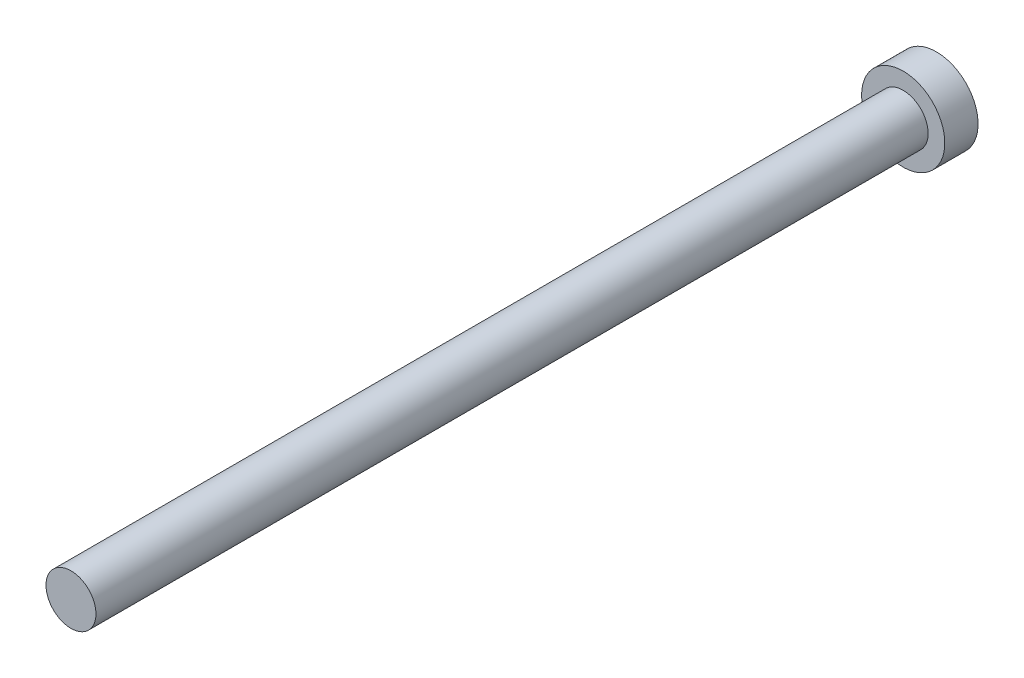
from build123d import *

# Parameters (mm, degrees)
SKETCH_1_R      = 1.5
EXTRUDE_1_DEPTH = 50
SKETCH_2_R      = 2.5
EXTRUDE_2_DEPTH = 2


with BuildPart() as part:
    # Sketch 1 → Extrude 1 (new body)
    with BuildSketch(Plane.XY):
        Circle(SKETCH_1_R)
    extrude(amount=EXTRUDE_1_DEPTH)

    # Sketch 2 → Extrude 2 (add)
    with BuildSketch(Plane(origin=(0, 0, 0), x_dir=(-1, 0, 0), z_dir=(0, 0, -1))):
        Circle(SKETCH_2_R)
    extrude(amount=EXTRUDE_2_DEPTH)


solid = part.part
